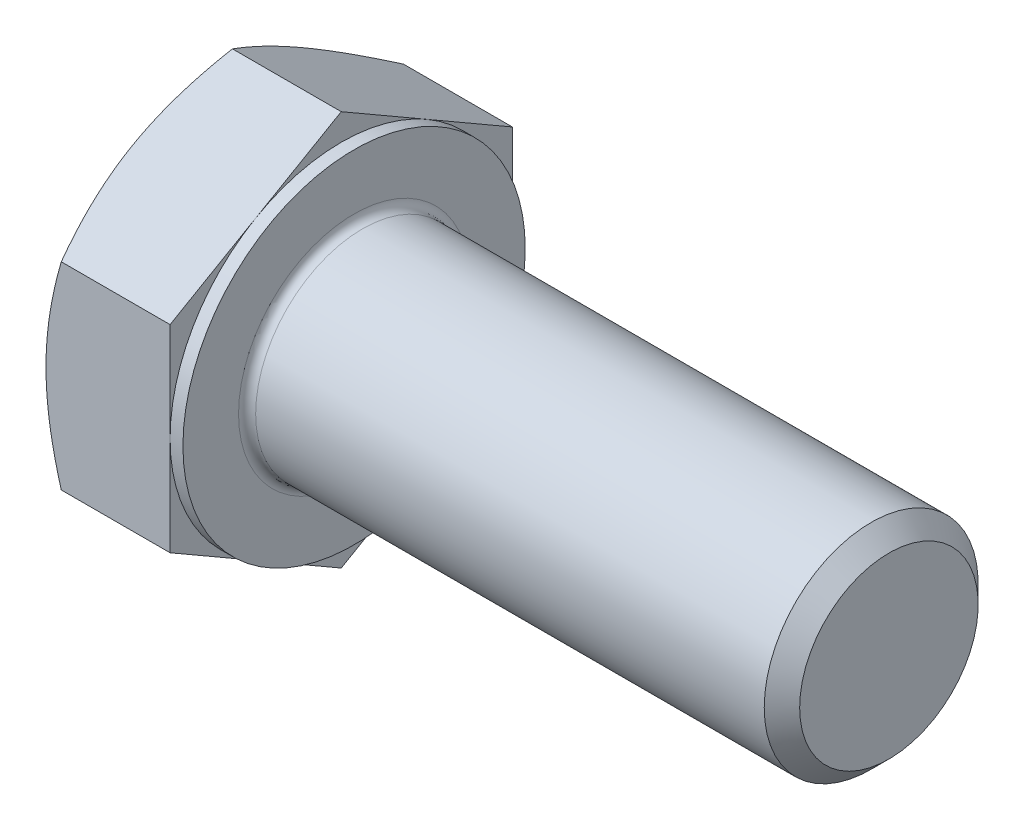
ISO-10303-21;
HEADER;
FILE_DESCRIPTION(('STEP AP214'),'2;1');
FILE_NAME('part.step','',(''),(''),'','','');
FILE_SCHEMA(('AUTOMOTIVE_DESIGN { 1 0 10303 214 1 1 1 1 }'));
ENDSEC;
DATA;
#1=APPLICATION_CONTEXT('core data for automotive mechanical design processes');
#2=APPLICATION_PROTOCOL_DEFINITION('international standard','automotive_design',2000,#1);
#3=PRODUCT_CONTEXT('',#1,'mechanical');
#4=PRODUCT('Part','Part','',(#3));
#5=PRODUCT_RELATED_PRODUCT_CATEGORY('part','',(#4));
#6=PRODUCT_DEFINITION_FORMATION('','',#4);
#7=PRODUCT_DEFINITION_CONTEXT('part definition',#1,'design');
#8=PRODUCT_DEFINITION('design','',#6,#7);
#9=PRODUCT_DEFINITION_SHAPE('','',#8);
#10=(LENGTH_UNIT() NAMED_UNIT(*) SI_UNIT(.MILLI.,.METRE.));
#11=(NAMED_UNIT(*) PLANE_ANGLE_UNIT() SI_UNIT($,.RADIAN.));
#12=(NAMED_UNIT(*) SI_UNIT($,.STERADIAN.) SOLID_ANGLE_UNIT());
#13=UNCERTAINTY_MEASURE_WITH_UNIT(LENGTH_MEASURE(1.E-05),#10,'distance_accuracy_value','');
#14=(GEOMETRIC_REPRESENTATION_CONTEXT(3) GLOBAL_UNCERTAINTY_ASSIGNED_CONTEXT((#13)) GLOBAL_UNIT_ASSIGNED_CONTEXT((#10,
#11,#12)) REPRESENTATION_CONTEXT('',''));
#15=CARTESIAN_POINT('',(0.,0.,0.));
#16=DIRECTION('',(0.,0.,1.));
#17=DIRECTION('',(1.,0.,0.));
#18=AXIS2_PLACEMENT_3D('',#15,#16,#17);
#19=CARTESIAN_POINT('',(6.4,9.23760430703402,0.));
#20=DIRECTION('',(1.,0.,0.));
#21=DIRECTION('',(0.,0.,-1.));
#22=AXIS2_PLACEMENT_3D('',#19,#20,#21);
#23=PLANE('',#22);
#24=CARTESIAN_POINT('',(6.4,0.,0.));
#25=DIRECTION('',(1.,0.,0.));
#26=DIRECTION('',(0.,0.,-1.));
#27=AXIS2_PLACEMENT_3D('',#24,#25,#26);
#28=CIRCLE('',#27,5.4);
#29=CARTESIAN_POINT('',(6.4,0.,-5.4));
#30=VERTEX_POINT('',#29);
#31=EDGE_CURVE('E44',#30,#30,#28,.F.);
#32=ORIENTED_EDGE('',*,*,#31,.T.);
#33=EDGE_LOOP('',(#32));
#34=FACE_BOUND('',#33,.T.);
#35=CARTESIAN_POINT('',(6.4,0.,0.));
#36=DIRECTION('',(1.,0.,0.));
#37=DIRECTION('',(0.,0.,-1.));
#38=AXIS2_PLACEMENT_3D('',#35,#36,#37);
#39=CIRCLE('',#38,8.);
#40=CARTESIAN_POINT('',(6.4,0.,-8.));
#41=VERTEX_POINT('',#40);
#42=EDGE_CURVE('E295',#41,#41,#39,.T.);
#43=ORIENTED_EDGE('',*,*,#42,.T.);
#44=EDGE_LOOP('',(#43));
#45=FACE_BOUND('',#44,.T.);
#46=ADVANCED_FACE('F36',(#34,#45),#23,.T.);
#47=CARTESIAN_POINT('',(0.,0.,0.));
#48=DIRECTION('',(-1.,0.,0.));
#49=DIRECTION('',(0.,0.,1.));
#50=AXIS2_PLACEMENT_3D('',#47,#48,#49);
#51=CYLINDRICAL_SURFACE('',#50,5.);
#52=CARTESIAN_POINT('',(6.8,0.,0.));
#53=DIRECTION('',(1.,0.,0.));
#54=DIRECTION('',(0.,0.,-1.));
#55=AXIS2_PLACEMENT_3D('',#52,#53,#54);
#56=CIRCLE('',#55,5.);
#57=CARTESIAN_POINT('',(6.8,0.,-5.));
#58=VERTEX_POINT('',#57);
#59=EDGE_CURVE('E11',#58,#58,#56,.T.);
#60=ORIENTED_EDGE('',*,*,#59,.T.);
#61=EDGE_LOOP('',(#60));
#62=FACE_BOUND('',#61,.T.);
#63=CARTESIAN_POINT('',(30.572,0.,0.));
#64=DIRECTION('',(-1.,0.,0.));
#65=DIRECTION('',(0.,0.,1.));
#66=AXIS2_PLACEMENT_3D('',#63,#64,#65);
#67=CIRCLE('',#66,5.);
#68=CARTESIAN_POINT('',(30.572,0.,5.));
#69=VERTEX_POINT('',#68);
#70=EDGE_CURVE('E274',#69,#69,#67,.T.);
#71=ORIENTED_EDGE('',*,*,#70,.T.);
#72=EDGE_LOOP('',(#71));
#73=FACE_BOUND('',#72,.T.);
#74=ADVANCED_FACE('F248',(#62,#73),#51,.T.);
#75=CARTESIAN_POINT('',(31.4,0.,0.));
#76=DIRECTION('',(-1.,0.,0.));
#77=DIRECTION('',(0.,0.,1.));
#78=AXIS2_PLACEMENT_3D('',#75,#76,#77);
#79=CONICAL_SURFACE('',#78,4.172,0.785398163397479);
#80=ORIENTED_EDGE('',*,*,#70,.F.);
#81=EDGE_LOOP('',(#80));
#82=FACE_BOUND('',#81,.T.);
#83=CARTESIAN_POINT('',(31.4,0.,0.));
#84=DIRECTION('',(-1.,0.,0.));
#85=DIRECTION('',(0.,0.,1.));
#86=AXIS2_PLACEMENT_3D('',#83,#84,#85);
#87=CIRCLE('',#86,4.172);
#88=CARTESIAN_POINT('',(31.4,0.,4.172));
#89=VERTEX_POINT('',#88);
#90=EDGE_CURVE('E272',#89,#89,#87,.T.);
#91=ORIENTED_EDGE('',*,*,#90,.T.);
#92=EDGE_LOOP('',(#91));
#93=FACE_BOUND('',#92,.T.);
#94=ADVANCED_FACE('F253',(#82,#93),#79,.T.);
#95=CARTESIAN_POINT('',(31.4,0.,0.));
#96=DIRECTION('',(-1.,0.,0.));
#97=DIRECTION('',(0.,0.,1.));
#98=AXIS2_PLACEMENT_3D('',#95,#96,#97);
#99=PLANE('',#98);
#100=ORIENTED_EDGE('',*,*,#90,.F.);
#101=EDGE_LOOP('',(#100));
#102=FACE_BOUND('',#101,.T.);
#103=ADVANCED_FACE('F260',(#102),#99,.F.);
#104=CARTESIAN_POINT('',(5.8,8.00000000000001,0.));
#105=DIRECTION('',(1.,0.,0.));
#106=DIRECTION('',(0.,0.,-1.));
#107=AXIS2_PLACEMENT_3D('',#104,#105,#106);
#108=PLANE('',#107);
#109=DIRECTION('',(0.,0.500000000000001,0.866025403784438));
#110=VECTOR('',#109,1.);
#111=CARTESIAN_POINT('',(5.8,4.61880215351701,-8.00000000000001));
#112=LINE('',#111,#110);
#113=CARTESIAN_POINT('',(5.8,4.61880215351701,-8.00000000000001));
#114=VERTEX_POINT('',#113);
#115=CARTESIAN_POINT('',(5.8,6.92820323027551,-4.));
#116=VERTEX_POINT('',#115);
#117=EDGE_CURVE('E168',#114,#116,#112,.T.);
#118=ORIENTED_EDGE('',*,*,#117,.T.);
#119=CARTESIAN_POINT('',(5.8,0.,0.));
#120=DIRECTION('',(-1.,0.,0.));
#121=DIRECTION('',(0.,0.,1.));
#122=AXIS2_PLACEMENT_3D('',#119,#120,#121);
#123=CIRCLE('',#122,8.);
#124=CARTESIAN_POINT('',(5.8,0.,-8.00000000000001));
#125=VERTEX_POINT('',#124);
#126=EDGE_CURVE('E51',#116,#125,#123,.T.);
#127=ORIENTED_EDGE('',*,*,#126,.T.);
#128=DIRECTION('',(0.,1.,0.));
#129=VECTOR('',#128,1.);
#130=CARTESIAN_POINT('',(5.8,4.61880215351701,-8.00000000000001));
#131=LINE('',#130,#129);
#132=EDGE_CURVE('E298',#125,#114,#131,.T.);
#133=ORIENTED_EDGE('',*,*,#132,.T.);
#134=EDGE_LOOP('',(#118,#127,#133));
#135=FACE_BOUND('',#134,.T.);
#136=ADVANCED_FACE('F263',(#135),#108,.T.);
#137=CARTESIAN_POINT('',(5.8,9.23760430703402,0.));
#138=VERTEX_POINT('',#137);
#139=EDGE_CURVE('E166',#116,#138,#112,.T.);
#140=ORIENTED_EDGE('',*,*,#139,.T.);
#141=DIRECTION('',(0.,-0.500000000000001,0.866025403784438));
#142=VECTOR('',#141,1.);
#143=CARTESIAN_POINT('',(5.8,9.23760430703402,0.));
#144=LINE('',#143,#142);
#145=CARTESIAN_POINT('',(5.8,6.92820323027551,4.));
#146=VERTEX_POINT('',#145);
#147=EDGE_CURVE('E165',#138,#146,#144,.T.);
#148=ORIENTED_EDGE('',*,*,#147,.T.);
#149=EDGE_CURVE('E154',#146,#116,#123,.T.);
#150=ORIENTED_EDGE('',*,*,#149,.T.);
#151=EDGE_LOOP('',(#140,#148,#150));
#152=FACE_BOUND('',#151,.T.);
#153=ADVANCED_FACE('F268',(#152),#108,.T.);
#154=CARTESIAN_POINT('',(5.8,4.61880215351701,7.99999999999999));
#155=VERTEX_POINT('',#154);
#156=EDGE_CURVE('E133',#146,#155,#144,.T.);
#157=ORIENTED_EDGE('',*,*,#156,.T.);
#158=DIRECTION('',(0.,-1.,0.));
#159=VECTOR('',#158,1.);
#160=CARTESIAN_POINT('',(5.8,4.61880215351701,7.99999999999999));
#161=LINE('',#160,#159);
#162=CARTESIAN_POINT('',(5.8,0.,8.00000000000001));
#163=VERTEX_POINT('',#162);
#164=EDGE_CURVE('E127',#155,#163,#161,.T.);
#165=ORIENTED_EDGE('',*,*,#164,.T.);
#166=EDGE_CURVE('E131',#163,#146,#123,.T.);
#167=ORIENTED_EDGE('',*,*,#166,.T.);
#168=EDGE_LOOP('',(#157,#165,#167));
#169=FACE_BOUND('',#168,.T.);
#170=ADVANCED_FACE('F129',(#169),#108,.T.);
#171=CARTESIAN_POINT('',(5.8,-4.618802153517,8.00000000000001));
#172=VERTEX_POINT('',#171);
#173=EDGE_CURVE('E137',#163,#172,#161,.T.);
#174=ORIENTED_EDGE('',*,*,#173,.T.);
#175=DIRECTION('',(0.,-0.500000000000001,-0.866025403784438));
#176=VECTOR('',#175,1.);
#177=CARTESIAN_POINT('',(5.8,-9.23760430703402,0.));
#178=LINE('',#177,#176);
#179=CARTESIAN_POINT('',(5.8,-6.92820323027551,4.));
#180=VERTEX_POINT('',#179);
#181=EDGE_CURVE('E144',#172,#180,#178,.T.);
#182=ORIENTED_EDGE('',*,*,#181,.T.);
#183=EDGE_CURVE('E141',#180,#163,#123,.T.);
#184=ORIENTED_EDGE('',*,*,#183,.T.);
#185=EDGE_LOOP('',(#174,#182,#184));
#186=FACE_BOUND('',#185,.T.);
#187=ADVANCED_FACE('F142',(#186),#108,.T.);
#188=CARTESIAN_POINT('',(5.8,-9.23760430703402,0.));
#189=VERTEX_POINT('',#188);
#190=EDGE_CURVE('E160',#180,#189,#178,.T.);
#191=ORIENTED_EDGE('',*,*,#190,.T.);
#192=DIRECTION('',(0.,0.5,-0.866025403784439));
#193=VECTOR('',#192,1.);
#194=CARTESIAN_POINT('',(5.8,-4.61880215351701,-8.00000000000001));
#195=LINE('',#194,#193);
#196=CARTESIAN_POINT('',(5.8,-6.92820323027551,-4.));
#197=VERTEX_POINT('',#196);
#198=EDGE_CURVE('E336',#189,#197,#195,.T.);
#199=ORIENTED_EDGE('',*,*,#198,.T.);
#200=EDGE_CURVE('E148',#197,#180,#123,.T.);
#201=ORIENTED_EDGE('',*,*,#200,.T.);
#202=EDGE_LOOP('',(#191,#199,#201));
#203=FACE_BOUND('',#202,.T.);
#204=ADVANCED_FACE('F337',(#203),#108,.T.);
#205=CARTESIAN_POINT('',(5.8,-4.61880215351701,-8.00000000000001));
#206=VERTEX_POINT('',#205);
#207=EDGE_CURVE('E155',#197,#206,#195,.T.);
#208=ORIENTED_EDGE('',*,*,#207,.T.);
#209=EDGE_CURVE('E299',#206,#125,#131,.T.);
#210=ORIENTED_EDGE('',*,*,#209,.T.);
#211=EDGE_CURVE('E306',#125,#197,#123,.T.);
#212=ORIENTED_EDGE('',*,*,#211,.T.);
#213=EDGE_LOOP('',(#208,#210,#212));
#214=FACE_BOUND('',#213,.T.);
#215=ADVANCED_FACE('F269',(#214),#108,.T.);
#216=CARTESIAN_POINT('',(0.,0.,0.));
#217=DIRECTION('',(-1.,0.,0.));
#218=DIRECTION('',(0.,0.,1.));
#219=AXIS2_PLACEMENT_3D('',#216,#217,#218);
#220=CYLINDRICAL_SURFACE('',#219,8.);
#221=ORIENTED_EDGE('',*,*,#126,.F.);
#222=ORIENTED_EDGE('',*,*,#149,.F.);
#223=ORIENTED_EDGE('',*,*,#166,.F.);
#224=ORIENTED_EDGE('',*,*,#183,.F.);
#225=ORIENTED_EDGE('',*,*,#200,.F.);
#226=ORIENTED_EDGE('',*,*,#211,.F.);
#227=EDGE_LOOP('',(#221,#222,#223,#224,#225,#226));
#228=FACE_BOUND('',#227,.T.);
#229=ORIENTED_EDGE('',*,*,#42,.F.);
#230=EDGE_LOOP('',(#229));
#231=FACE_BOUND('',#230,.T.);
#232=ADVANCED_FACE('F151',(#228,#231),#220,.T.);
#233=CARTESIAN_POINT('',(0.,9.23760430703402,0.));
#234=DIRECTION('',(1.,0.,0.));
#235=DIRECTION('',(0.,0.,-1.));
#236=AXIS2_PLACEMENT_3D('',#233,#234,#235);
#237=PLANE('',#236);
#238=CARTESIAN_POINT('',(0.,0.,0.));
#239=DIRECTION('',(1.,0.,0.));
#240=DIRECTION('',(0.,0.,-1.));
#241=AXIS2_PLACEMENT_3D('',#238,#239,#240);
#242=CIRCLE('',#241,8.);
#243=CARTESIAN_POINT('',(0.,0.,-8.00000000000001));
#244=VERTEX_POINT('',#243);
#245=CARTESIAN_POINT('',(0.,6.92820323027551,-4.));
#246=VERTEX_POINT('',#245);
#247=EDGE_CURVE('E294',#244,#246,#242,.T.);
#248=ORIENTED_EDGE('',*,*,#247,.F.);
#249=CARTESIAN_POINT('',(0.,-6.92820323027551,-4.));
#250=VERTEX_POINT('',#249);
#251=EDGE_CURVE('E290',#250,#244,#242,.T.);
#252=ORIENTED_EDGE('',*,*,#251,.F.);
#253=CARTESIAN_POINT('',(0.,-6.9282032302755,4.));
#254=VERTEX_POINT('',#253);
#255=EDGE_CURVE('E293',#254,#250,#242,.T.);
#256=ORIENTED_EDGE('',*,*,#255,.F.);
#257=CARTESIAN_POINT('',(0.,0.,8.00000000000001));
#258=VERTEX_POINT('',#257);
#259=EDGE_CURVE('E329',#258,#254,#242,.T.);
#260=ORIENTED_EDGE('',*,*,#259,.F.);
#261=CARTESIAN_POINT('',(0.,0.,0.));
#262=DIRECTION('',(-1.,0.,0.));
#263=DIRECTION('',(0.,0.,1.));
#264=AXIS2_PLACEMENT_3D('',#261,#262,#263);
#265=CIRCLE('',#264,8.);
#266=CARTESIAN_POINT('',(0.,6.92820323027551,4.));
#267=VERTEX_POINT('',#266);
#268=EDGE_CURVE('E169',#258,#267,#265,.T.);
#269=ORIENTED_EDGE('',*,*,#268,.T.);
#270=EDGE_CURVE('E352',#246,#267,#242,.T.);
#271=ORIENTED_EDGE('',*,*,#270,.F.);
#272=EDGE_LOOP('',(#248,#252,#256,#260,#269,#271));
#273=FACE_BOUND('',#272,.T.);
#274=ADVANCED_FACE('F198',(#273),#237,.F.);
#275=CARTESIAN_POINT('',(0.,0.,0.));
#276=DIRECTION('',(1.,0.,0.));
#277=DIRECTION('',(0.,0.,-1.));
#278=AXIS2_PLACEMENT_3D('',#275,#276,#277);
#279=CONICAL_SURFACE('',#278,8.,1.0471975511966);
#280=CARTESIAN_POINT('',(0.714597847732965,4.61868668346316,8.0002));
#281=CARTESIAN_POINT('',(0.655990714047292,4.72021302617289,7.8243512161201));
#282=CARTESIAN_POINT('',(0.600043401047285,4.82211789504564,7.64784680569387));
#283=CARTESIAN_POINT('',(0.494201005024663,5.02675523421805,7.29340453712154));
#284=CARTESIAN_POINT('',(0.444308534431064,5.12948804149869,7.11546609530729));
#285=CARTESIAN_POINT('',(0.304692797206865,5.43933133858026,6.57880176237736));
#286=CARTESIAN_POINT('',(0.225281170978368,5.64766491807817,6.21795741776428));
#287=CARTESIAN_POINT('',(0.132161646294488,5.95943209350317,5.67796082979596));
#288=CARTESIAN_POINT('',(0.105634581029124,6.06193429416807,5.50042181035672));
#289=CARTESIAN_POINT('',(0.0611531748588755,6.26740224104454,5.14454088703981));
#290=CARTESIAN_POINT('',(0.0431980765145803,6.37036794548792,4.96619905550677));
#291=CARTESIAN_POINT('',(0.0163156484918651,6.57647664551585,4.60920831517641));
#292=CARTESIAN_POINT('',(0.00737807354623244,6.67961930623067,4.43055998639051));
#293=CARTESIAN_POINT('',(-0.00127769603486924,6.88599991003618,4.07309829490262));
#294=CARTESIAN_POINT('',(-0.000996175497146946,6.98923785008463,3.89428493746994));
#295=CARTESIAN_POINT('',(0.00814502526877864,7.18224506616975,3.5599866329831));
#296=CARTESIAN_POINT('',(0.0158896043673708,7.27202796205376,3.40447809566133));
#297=CARTESIAN_POINT('',(0.0382011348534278,7.45138347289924,3.0938252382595));
#298=CARTESIAN_POINT('',(0.0527685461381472,7.5409560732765,2.93868094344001));
#299=CARTESIAN_POINT('',(0.106360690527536,7.80932710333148,2.47384868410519));
#300=CARTESIAN_POINT('',(0.155268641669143,7.98765049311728,2.16498351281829));
#301=CARTESIAN_POINT('',(0.277539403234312,8.34618890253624,1.54397677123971));
#302=CARTESIAN_POINT('',(0.351420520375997,8.52635816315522,1.23191445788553));
#303=CARTESIAN_POINT('',(0.519100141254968,8.88400987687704,0.612443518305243));
#304=CARTESIAN_POINT('',(0.612859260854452,9.06149691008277,0.305026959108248));
#305=CARTESIAN_POINT('',(0.714597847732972,9.23771977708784,-0.000200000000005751));
#306=B_SPLINE_CURVE_WITH_KNOTS('',3,(#280,#281,#282,#283,#284,#285,#286,#287,#288,#289,#290,
#291,#292,#293,#294,#295,#296,#297,#298,#299,#300,#301,#302,#303,#304,#305),.UNSPECIFIED.,.F.,
.F.,(4,2,2,2,2,2,2,2,2,2,2,2,4),(0.,0.63397354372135,1.26821965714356,2.53934712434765,
3.15934343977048,3.77928496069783,4.39852133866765,5.01773858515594,5.55680239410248,
6.09590254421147,7.17487077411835,8.27776850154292,9.37850115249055),.UNSPECIFIED.);
#307=CARTESIAN_POINT('',(0.714531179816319,9.23760430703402,0.));
#308=VERTEX_POINT('',#307);
#309=EDGE_CURVE('E217',#267,#308,#306,.T.);
#310=ORIENTED_EDGE('',*,*,#309,.T.);
#311=CARTESIAN_POINT('',(0.714597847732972,9.23771977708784,0.000200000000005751));
#312=CARTESIAN_POINT('',(0.6559907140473,9.13619343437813,-0.175648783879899));
#313=CARTESIAN_POINT('',(0.600043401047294,9.03428856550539,-0.352153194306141));
#314=CARTESIAN_POINT('',(0.494201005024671,8.82965122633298,-0.706595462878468));
#315=CARTESIAN_POINT('',(0.444308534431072,8.72691841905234,-0.884533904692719));
#316=CARTESIAN_POINT('',(0.304692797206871,8.41707512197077,-1.42119823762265));
#317=CARTESIAN_POINT('',(0.225281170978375,8.20874154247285,-1.78204258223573));
#318=CARTESIAN_POINT('',(0.132161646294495,7.89697436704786,-2.32203917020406));
#319=CARTESIAN_POINT('',(0.10563458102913,7.79447216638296,-2.49957818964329));
#320=CARTESIAN_POINT('',(0.0611531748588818,7.58900421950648,-2.8554591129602));
#321=CARTESIAN_POINT('',(0.043198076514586,7.48603851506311,-3.03380094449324));
#322=CARTESIAN_POINT('',(0.0163156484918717,7.27992981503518,-3.3907916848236));
#323=CARTESIAN_POINT('',(0.0073780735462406,7.17678715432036,-3.56944001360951));
#324=CARTESIAN_POINT('',(-0.00127769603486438,6.97040655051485,-3.92690170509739));
#325=CARTESIAN_POINT('',(-0.000996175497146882,6.86716861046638,-4.10571506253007));
#326=CARTESIAN_POINT('',(0.00814502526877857,6.67416139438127,-4.44001336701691));
#327=CARTESIAN_POINT('',(0.0158896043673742,6.58437849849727,-4.59552190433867));
#328=CARTESIAN_POINT('',(0.0382011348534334,6.40502298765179,-4.90617476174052));
#329=CARTESIAN_POINT('',(0.0527685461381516,6.31545038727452,-5.06131905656));
#330=CARTESIAN_POINT('',(0.106360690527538,6.04707935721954,-5.52615131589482));
#331=CARTESIAN_POINT('',(0.155268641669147,5.86875596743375,-5.83501648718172));
#332=CARTESIAN_POINT('',(0.277539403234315,5.51021755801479,-6.4560232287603));
#333=CARTESIAN_POINT('',(0.351420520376,5.33004829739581,-6.76808554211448));
#334=CARTESIAN_POINT('',(0.519100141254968,4.97239658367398,-7.38755648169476));
#335=CARTESIAN_POINT('',(0.612859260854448,4.79490955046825,-7.69497304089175));
#336=CARTESIAN_POINT('',(0.714597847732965,4.61868668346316,-8.0002));
#337=B_SPLINE_CURVE_WITH_KNOTS('',3,(#311,#312,#313,#314,#315,#316,#317,#318,#319,#320,#321,
#322,#323,#324,#325,#326,#327,#328,#329,#330,#331,#332,#333,#334,#335,#336),.UNSPECIFIED.,.F.,
.F.,(4,2,2,2,2,2,2,2,2,2,2,2,4),(0.,0.63397354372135,1.26821965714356,2.53934712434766,
3.15934343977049,3.77928496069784,4.39852133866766,5.01773858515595,5.55680239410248,
6.09590254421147,7.17487077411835,8.27776850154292,9.37850115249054),.UNSPECIFIED.);
#338=EDGE_CURVE('E59',#308,#246,#337,.T.);
#339=ORIENTED_EDGE('',*,*,#338,.T.);
#340=ORIENTED_EDGE('',*,*,#270,.T.);
#341=EDGE_LOOP('',(#310,#339,#340));
#342=FACE_BOUND('',#341,.T.);
#343=ADVANCED_FACE('F353',(#342),#279,.T.);
#344=CARTESIAN_POINT('',(4.02490591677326,-12.6546855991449,8.00000000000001));
#345=CARTESIAN_POINT('',(3.85338488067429,-12.3031246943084,8.));
#346=CARTESIAN_POINT('',(3.68343820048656,-11.9507829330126,8.));
#347=CARTESIAN_POINT('',(3.3475742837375,-11.2441233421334,8.));
#348=CARTESIAN_POINT('',(3.18165763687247,-10.8898052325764,8.));
#349=CARTESIAN_POINT('',(2.85395194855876,-10.177068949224,8.));
#350=CARTESIAN_POINT('',(2.69218825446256,-9.81863908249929,8.));
#351=CARTESIAN_POINT('',(2.37495727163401,-9.09901413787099,8.));
#352=CARTESIAN_POINT('',(2.21948970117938,-8.73781918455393,8.));
#353=CARTESIAN_POINT('',(1.91124909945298,-7.9995005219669,8.));
#354=CARTESIAN_POINT('',(1.75875676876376,-7.6222589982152,8.));
#355=CARTESIAN_POINT('',(1.46472411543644,-6.86345577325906,8.));
#356=CARTESIAN_POINT('',(1.32318498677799,-6.48189360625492,8.));
#357=CARTESIAN_POINT('',(1.05459432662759,-5.71447512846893,7.99999999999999));
#358=CARTESIAN_POINT('',(0.927515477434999,-5.32862847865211,7.99999999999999));
#359=CARTESIAN_POINT('',(0.691757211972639,-4.55141880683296,8.));
#360=CARTESIAN_POINT('',(0.583072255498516,-4.16005748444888,8.00000000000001));
#361=CARTESIAN_POINT('',(0.389750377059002,-3.37376378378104,8.00000000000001));
#362=CARTESIAN_POINT('',(0.304973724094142,-2.97886668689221,8.));
#363=CARTESIAN_POINT('',(0.199275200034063,-2.38273452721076,7.99999999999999));
#364=CARTESIAN_POINT('',(0.167618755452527,-2.18337977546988,7.99999999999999));
#365=CARTESIAN_POINT('',(0.112075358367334,-1.78359737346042,7.99999999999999));
#366=CARTESIAN_POINT('',(0.088187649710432,-1.58316982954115,7.99999999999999));
#367=CARTESIAN_POINT('',(0.0489706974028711,-1.18423541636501,7.99999999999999));
#368=CARTESIAN_POINT('',(0.0335291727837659,-0.985739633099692,7.99999999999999));
#369=CARTESIAN_POINT('',(0.0110629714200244,-0.588272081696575,7.99999999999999));
#370=CARTESIAN_POINT('',(0.00403814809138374,-0.389300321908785,7.99999999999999));
#371=CARTESIAN_POINT('',(-0.00142584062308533,0.00876221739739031,7.99999999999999));
#372=CARTESIAN_POINT('',(0.00013495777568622,0.207852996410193,7.99999999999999));
#373=CARTESIAN_POINT('',(0.0118014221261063,0.605786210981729,7.99999999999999));
#374=CARTESIAN_POINT('',(0.0219074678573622,0.804628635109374,7.99999999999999));
#375=CARTESIAN_POINT('',(0.0557165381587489,1.27520492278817,7.99999999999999));
#376=CARTESIAN_POINT('',(0.0830672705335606,1.5466829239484,7.99999999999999));
#377=CARTESIAN_POINT('',(0.152259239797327,2.08777093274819,7.99999999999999));
#378=CARTESIAN_POINT('',(0.194102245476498,2.3573807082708,7.99999999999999));
#379=CARTESIAN_POINT('',(0.339163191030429,3.1630177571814,7.99999999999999));
#380=CARTESIAN_POINT('',(0.461891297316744,3.69558689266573,7.99999999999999));
#381=CARTESIAN_POINT('',(0.67658659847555,4.49226054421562,7.99999999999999));
#382=CARTESIAN_POINT('',(0.754301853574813,4.76044513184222,7.99999999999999));
#383=CARTESIAN_POINT('',(0.918275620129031,5.29421545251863,7.99999999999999));
#384=CARTESIAN_POINT('',(1.00453419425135,5.55980116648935,7.99999999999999));
#385=CARTESIAN_POINT('',(1.18417203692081,6.08844838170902,7.99999999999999));
#386=CARTESIAN_POINT('',(1.27754932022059,6.35151056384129,7.99999999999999));
#387=CARTESIAN_POINT('',(1.47027925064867,6.8754242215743,7.99999999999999));
#388=CARTESIAN_POINT('',(1.56963178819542,7.13627573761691,7.99999999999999));
#389=CARTESIAN_POINT('',(1.83061788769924,7.80218876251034,7.99999999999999));
#390=CARTESIAN_POINT('',(1.99585031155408,8.20583801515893,7.99999999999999));
#391=CARTESIAN_POINT('',(2.33560644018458,9.00922091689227,7.99999999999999));
#392=CARTESIAN_POINT('',(2.51013099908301,9.4089542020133,7.99999999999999));
#393=CARTESIAN_POINT('',(2.86641485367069,10.2053302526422,7.99999999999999));
#394=CARTESIAN_POINT('',(3.04817649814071,10.6019719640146,7.99999999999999));
#395=CARTESIAN_POINT('',(3.41731475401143,11.3926098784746,7.99999999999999));
#396=CARTESIAN_POINT('',(3.60469118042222,11.7866061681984,7.99999999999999));
#397=CARTESIAN_POINT('',(3.98417977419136,12.5730081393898,7.99999999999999));
#398=CARTESIAN_POINT('',(4.17629838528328,12.9654107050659,7.99999999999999));
#399=CARTESIAN_POINT('',(4.56413461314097,13.7484335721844,7.99999999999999));
#400=CARTESIAN_POINT('',(4.75985225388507,14.1390538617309,7.99999999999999));
#401=CARTESIAN_POINT('',(5.15417791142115,14.9187387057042,7.99999999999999));
#402=CARTESIAN_POINT('',(5.35278537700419,15.3078035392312,7.99999999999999));
#403=CARTESIAN_POINT('',(5.75241278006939,16.0846929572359,7.99999999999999));
#404=CARTESIAN_POINT('',(5.95343272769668,16.4725175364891,7.99999999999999));
#405=CARTESIAN_POINT('',(6.52023158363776,17.559169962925,7.99999999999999));
#406=CARTESIAN_POINT('',(6.88826669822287,18.2568208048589,7.99999999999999));
#407=CARTESIAN_POINT('',(7.62911646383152,19.6496204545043,7.99999999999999));
#408=CARTESIAN_POINT('',(8.00193136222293,20.3447691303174,7.99999999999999));
#409=CARTESIAN_POINT('',(8.74998840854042,21.7309493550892,7.99999999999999));
#410=CARTESIAN_POINT('',(9.12521930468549,22.4219869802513,7.99999999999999));
#411=CARTESIAN_POINT('',(9.69012626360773,23.4573861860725,7.99999999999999));
#412=CARTESIAN_POINT('',(9.87876537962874,23.8023143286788,7.99999999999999));
#413=CARTESIAN_POINT('',(10.2566598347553,24.491832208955,7.99999999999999));
#414=CARTESIAN_POINT('',(10.4459151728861,24.8364219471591,7.99999999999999));
#415=CARTESIAN_POINT('',(10.6354414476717,25.1808626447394,7.99999999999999));
#416=B_SPLINE_CURVE_WITH_KNOTS('',3,(#344,#345,#346,#347,#348,#349,#350,#351,#352,#353,#354,
#355,#356,#357,#358,#359,#360,#361,#362,#363,#364,#365,#366,#367,#368,#369,#370,#371,#372,#373,
#374,#375,#376,#377,#378,#379,#380,#381,#382,#383,#384,#385,#386,#387,#388,#389,#390,#391,#392,
#393,#394,#395,#396,#397,#398,#399,#400,#401,#402,#403,#404,#405,#406,#407,#408,#409,#410,#411,
#412,#413,#414,#415),.UNSPECIFIED.,.F.,.F.,(4,2,2,2,2,2,2,2,2,2,2,2,2,2,2,2,2,2,2,2,2,2,2,2,2,2,
2,2,2,2,2,2,2,2,2,4),(0.,1.17352534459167,2.34722138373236,3.52689945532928,4.70652468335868,
5.92708318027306,7.14777454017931,8.36612013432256,9.58409810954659,10.7948027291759,
11.40023293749,12.0056041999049,12.6027191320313,13.1998236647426,13.7969256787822,
14.3940542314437,15.2121538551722,16.0303533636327,17.6675489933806,18.5051258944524,
19.3427089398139,20.180059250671,21.0173942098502,22.3257038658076,23.6341339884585,
24.9429922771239,26.2518074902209,27.5625113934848,28.8732240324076,30.1836898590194,
31.4941611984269,33.8604586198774,36.2268790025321,38.5858914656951,39.7653151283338,
40.9447369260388),.UNSPECIFIED.);
#417=CARTESIAN_POINT('',(0.714531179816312,4.61880215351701,7.99999999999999));
#418=VERTEX_POINT('',#417);
#419=EDGE_CURVE('E229',#258,#418,#416,.T.);
#420=ORIENTED_EDGE('',*,*,#419,.T.);
#421=EDGE_CURVE('E228',#418,#267,#306,.T.);
#422=ORIENTED_EDGE('',*,*,#421,.T.);
#423=ORIENTED_EDGE('',*,*,#268,.F.);
#424=EDGE_LOOP('',(#420,#422,#423));
#425=FACE_BOUND('',#424,.T.);
#426=ADVANCED_FACE('F323',(#425),#279,.T.);
#427=CARTESIAN_POINT('',(0.714531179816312,-4.618802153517,8.00000000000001));
#428=VERTEX_POINT('',#427);
#429=EDGE_CURVE('E275',#428,#258,#416,.T.);
#430=ORIENTED_EDGE('',*,*,#429,.T.);
#431=ORIENTED_EDGE('',*,*,#259,.T.);
#432=CARTESIAN_POINT('',(0.714597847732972,-9.23771977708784,-0.000200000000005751));
#433=CARTESIAN_POINT('',(0.655990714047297,-9.13619343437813,0.175648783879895));
#434=CARTESIAN_POINT('',(0.60004340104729,-9.03428856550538,0.352153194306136));
#435=CARTESIAN_POINT('',(0.494201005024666,-8.82965122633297,0.706595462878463));
#436=CARTESIAN_POINT('',(0.444308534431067,-8.72691841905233,0.884533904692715));
#437=CARTESIAN_POINT('',(0.304692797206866,-8.41707512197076,1.42119823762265));
#438=CARTESIAN_POINT('',(0.225281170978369,-8.20874154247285,1.78204258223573));
#439=CARTESIAN_POINT('',(0.132161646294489,-7.89697436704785,2.32203917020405));
#440=CARTESIAN_POINT('',(0.105634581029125,-7.79447216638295,2.49957818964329));
#441=CARTESIAN_POINT('',(0.0611531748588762,-7.58900421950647,2.8554591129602));
#442=CARTESIAN_POINT('',(0.0431980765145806,-7.4860385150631,3.03380094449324));
#443=CARTESIAN_POINT('',(0.0163156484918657,-7.27992981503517,3.3907916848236));
#444=CARTESIAN_POINT('',(0.00737807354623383,-7.17678715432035,3.56944001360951));
#445=CARTESIAN_POINT('',(-0.00127769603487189,-6.97040655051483,3.92690170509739));
#446=CARTESIAN_POINT('',(-0.000996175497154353,-6.86716861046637,4.10571506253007));
#447=CARTESIAN_POINT('',(0.00814502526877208,-6.67416139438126,4.44001336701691));
#448=CARTESIAN_POINT('',(0.0158896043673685,-6.58437849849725,4.59552190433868));
#449=CARTESIAN_POINT('',(0.0382011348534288,-6.40502298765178,4.90617476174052));
#450=CARTESIAN_POINT('',(0.0527685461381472,-6.31545038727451,5.06131905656));
#451=CARTESIAN_POINT('',(0.106360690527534,-6.04707935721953,5.52615131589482));
#452=CARTESIAN_POINT('',(0.155268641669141,-5.86875596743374,5.83501648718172));
#453=CARTESIAN_POINT('',(0.277539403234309,-5.51021755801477,6.4560232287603));
#454=CARTESIAN_POINT('',(0.351420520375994,-5.3300482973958,6.76808554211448));
#455=CARTESIAN_POINT('',(0.519100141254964,-4.97239658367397,7.38755648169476));
#456=CARTESIAN_POINT('',(0.612859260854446,-4.79490955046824,7.69497304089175));
#457=CARTESIAN_POINT('',(0.714597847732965,-4.61868668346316,8.0002));
#458=B_SPLINE_CURVE_WITH_KNOTS('',3,(#432,#433,#434,#435,#436,#437,#438,#439,#440,#441,#442,
#443,#444,#445,#446,#447,#448,#449,#450,#451,#452,#453,#454,#455,#456,#457),.UNSPECIFIED.,.F.,
.F.,(4,2,2,2,2,2,2,2,2,2,2,2,4),(0.,0.633973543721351,1.26821965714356,2.53934712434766,
3.15934343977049,3.77928496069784,4.39852133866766,5.01773858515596,5.55680239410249,
6.09590254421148,7.17487077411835,8.27776850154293,9.37850115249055),.UNSPECIFIED.);
#459=EDGE_CURVE('E219',#254,#428,#458,.T.);
#460=ORIENTED_EDGE('',*,*,#459,.T.);
#461=EDGE_LOOP('',(#430,#431,#460));
#462=FACE_BOUND('',#461,.T.);
#463=ADVANCED_FACE('F187',(#462),#279,.T.);
#464=CARTESIAN_POINT('',(0.714531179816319,-9.23760430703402,0.));
#465=VERTEX_POINT('',#464);
#466=EDGE_CURVE('E212',#465,#254,#458,.T.);
#467=ORIENTED_EDGE('',*,*,#466,.T.);
#468=ORIENTED_EDGE('',*,*,#255,.T.);
#469=CARTESIAN_POINT('',(0.714597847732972,-4.61868668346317,-8.0002));
#470=CARTESIAN_POINT('',(0.655990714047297,-4.7202130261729,-7.8243512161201));
#471=CARTESIAN_POINT('',(0.60004340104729,-4.82211789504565,-7.64784680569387));
#472=CARTESIAN_POINT('',(0.494201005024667,-5.02675523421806,-7.29340453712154));
#473=CARTESIAN_POINT('',(0.444308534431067,-5.1294880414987,-7.11546609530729));
#474=CARTESIAN_POINT('',(0.304692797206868,-5.43933133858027,-6.57880176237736));
#475=CARTESIAN_POINT('',(0.225281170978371,-5.64766491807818,-6.21795741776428));
#476=CARTESIAN_POINT('',(0.132161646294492,-5.95943209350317,-5.67796082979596));
#477=CARTESIAN_POINT('',(0.105634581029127,-6.06193429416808,-5.50042181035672));
#478=CARTESIAN_POINT('',(0.0611531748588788,-6.26740224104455,-5.14454088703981));
#479=CARTESIAN_POINT('',(0.0431980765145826,-6.37036794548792,-4.96619905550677));
#480=CARTESIAN_POINT('',(0.016315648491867,-6.57647664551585,-4.60920831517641));
#481=CARTESIAN_POINT('',(0.00737807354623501,-6.67961930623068,-4.43055998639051));
#482=CARTESIAN_POINT('',(-0.00127769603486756,-6.88599991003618,-4.07309829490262));
#483=CARTESIAN_POINT('',(-0.000996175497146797,-6.98923785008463,-3.89428493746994));
#484=CARTESIAN_POINT('',(0.00814502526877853,-7.18224506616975,-3.5599866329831));
#485=CARTESIAN_POINT('',(0.0158896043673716,-7.27202796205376,-3.40447809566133));
#486=CARTESIAN_POINT('',(0.0382011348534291,-7.45138347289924,-3.0938252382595));
#487=CARTESIAN_POINT('',(0.0527685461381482,-7.54095607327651,-2.93868094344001));
#488=CARTESIAN_POINT('',(0.106360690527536,-7.80932710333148,-2.47384868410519));
#489=CARTESIAN_POINT('',(0.155268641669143,-7.98765049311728,-2.16498351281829));
#490=CARTESIAN_POINT('',(0.277539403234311,-8.34618890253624,-1.5439767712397));
#491=CARTESIAN_POINT('',(0.351420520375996,-8.52635816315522,-1.23191445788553));
#492=CARTESIAN_POINT('',(0.519100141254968,-8.88400987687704,-0.612443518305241));
#493=CARTESIAN_POINT('',(0.612859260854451,-9.06149691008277,-0.305026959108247));
#494=CARTESIAN_POINT('',(0.714597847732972,-9.23771977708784,0.000200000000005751));
#495=B_SPLINE_CURVE_WITH_KNOTS('',3,(#469,#470,#471,#472,#473,#474,#475,#476,#477,#478,#479,
#480,#481,#482,#483,#484,#485,#486,#487,#488,#489,#490,#491,#492,#493,#494),.UNSPECIFIED.,.F.,
.F.,(4,2,2,2,2,2,2,2,2,2,2,2,4),(0.,0.633973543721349,1.26821965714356,2.53934712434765,
3.15934343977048,3.77928496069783,4.39852133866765,5.01773858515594,5.55680239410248,
6.09590254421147,7.17487077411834,8.27776850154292,9.37850115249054),.UNSPECIFIED.);
#496=EDGE_CURVE('E218',#250,#465,#495,.T.);
#497=ORIENTED_EDGE('',*,*,#496,.T.);
#498=EDGE_LOOP('',(#467,#468,#497));
#499=FACE_BOUND('',#498,.T.);
#500=ADVANCED_FACE('F351',(#499),#279,.T.);
#501=CARTESIAN_POINT('',(0.714531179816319,4.61880215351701,-8.00000000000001));
#502=VERTEX_POINT('',#501);
#503=EDGE_CURVE('E220',#246,#502,#337,.T.);
#504=ORIENTED_EDGE('',*,*,#503,.T.);
#505=CARTESIAN_POINT('',(4.02490591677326,-12.6546855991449,-8.00000000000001));
#506=CARTESIAN_POINT('',(3.85338488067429,-12.3031246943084,-8.00000000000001));
#507=CARTESIAN_POINT('',(3.68343820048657,-11.9507829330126,-8.00000000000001));
#508=CARTESIAN_POINT('',(3.34757428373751,-11.2441233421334,-8.00000000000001));
#509=CARTESIAN_POINT('',(3.18165763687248,-10.8898052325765,-8.00000000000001));
#510=CARTESIAN_POINT('',(2.85395194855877,-10.177068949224,-8.00000000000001));
#511=CARTESIAN_POINT('',(2.69218825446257,-9.8186390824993,-8.00000000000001));
#512=CARTESIAN_POINT('',(2.37495727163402,-9.099014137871,-8.00000000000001));
#513=CARTESIAN_POINT('',(2.21948970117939,-8.73781918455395,-8.00000000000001));
#514=CARTESIAN_POINT('',(1.91124909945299,-7.99950052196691,-8.00000000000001));
#515=CARTESIAN_POINT('',(1.75875676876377,-7.62225899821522,-8.00000000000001));
#516=CARTESIAN_POINT('',(1.46472411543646,-6.86345577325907,-8.00000000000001));
#517=CARTESIAN_POINT('',(1.32318498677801,-6.48189360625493,-8.00000000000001));
#518=CARTESIAN_POINT('',(1.0545943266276,-5.71447512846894,-8.00000000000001));
#519=CARTESIAN_POINT('',(0.92751547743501,-5.32862847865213,-8.00000000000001));
#520=CARTESIAN_POINT('',(0.691757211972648,-4.55141880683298,-8.00000000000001));
#521=CARTESIAN_POINT('',(0.583072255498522,-4.16005748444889,-8.00000000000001));
#522=CARTESIAN_POINT('',(0.389750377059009,-3.37376378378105,-8.00000000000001));
#523=CARTESIAN_POINT('',(0.304973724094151,-2.97886668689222,-8.00000000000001));
#524=CARTESIAN_POINT('',(0.199275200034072,-2.38273452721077,-8.00000000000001));
#525=CARTESIAN_POINT('',(0.167618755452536,-2.18337977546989,-8.00000000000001));
#526=CARTESIAN_POINT('',(0.112075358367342,-1.78359737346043,-8.00000000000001));
#527=CARTESIAN_POINT('',(0.0881876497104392,-1.58316982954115,-8.00000000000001));
#528=CARTESIAN_POINT('',(0.0489706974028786,-1.18423541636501,-8.00000000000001));
#529=CARTESIAN_POINT('',(0.0335291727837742,-0.985739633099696,-8.00000000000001));
#530=CARTESIAN_POINT('',(0.011062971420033,-0.588272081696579,-8.00000000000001));
#531=CARTESIAN_POINT('',(0.00403814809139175,-0.389300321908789,-8.00000000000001));
#532=CARTESIAN_POINT('',(-0.00142584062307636,0.00876221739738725,-8.00000000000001));
#533=CARTESIAN_POINT('',(0.00013495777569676,0.20785299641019,-8.00000000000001));
#534=CARTESIAN_POINT('',(0.0118014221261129,0.605786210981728,-8.00000000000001));
#535=CARTESIAN_POINT('',(0.0219074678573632,0.804628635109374,-8.00000000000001));
#536=CARTESIAN_POINT('',(0.0557165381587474,1.27520492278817,-8.00000000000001));
#537=CARTESIAN_POINT('',(0.0830672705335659,1.54668292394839,-8.00000000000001));
#538=CARTESIAN_POINT('',(0.152259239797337,2.08777093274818,-8.00000000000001));
#539=CARTESIAN_POINT('',(0.194102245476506,2.3573807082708,-8.00000000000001));
#540=CARTESIAN_POINT('',(0.339163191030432,3.16301775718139,-8.00000000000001));
#541=CARTESIAN_POINT('',(0.461891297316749,3.69558689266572,-8.00000000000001));
#542=CARTESIAN_POINT('',(0.676586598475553,4.4922605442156,-8.00000000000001));
#543=CARTESIAN_POINT('',(0.754301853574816,4.7604451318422,-8.00000000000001));
#544=CARTESIAN_POINT('',(0.918275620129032,5.29421545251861,-8.00000000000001));
#545=CARTESIAN_POINT('',(1.00453419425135,5.55980116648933,-8.00000000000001));
#546=CARTESIAN_POINT('',(1.1841720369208,6.088448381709,-8.00000000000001));
#547=CARTESIAN_POINT('',(1.27754932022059,6.35151056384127,-8.00000000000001));
#548=CARTESIAN_POINT('',(1.47027925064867,6.87542422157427,-8.00000000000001));
#549=CARTESIAN_POINT('',(1.56963178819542,7.13627573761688,-8.00000000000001));
#550=CARTESIAN_POINT('',(1.83061788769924,7.80218876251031,-8.00000000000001));
#551=CARTESIAN_POINT('',(1.99585031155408,8.20583801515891,-8.00000000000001));
#552=CARTESIAN_POINT('',(2.33560644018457,9.00922091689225,-8.00000000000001));
#553=CARTESIAN_POINT('',(2.51013099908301,9.40895420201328,-8.00000000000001));
#554=CARTESIAN_POINT('',(2.86641485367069,10.2053302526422,-8.00000000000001));
#555=CARTESIAN_POINT('',(3.04817649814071,10.6019719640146,-8.00000000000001));
#556=CARTESIAN_POINT('',(3.41731475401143,11.3926098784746,-8.00000000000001));
#557=CARTESIAN_POINT('',(3.60469118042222,11.7866061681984,-8.00000000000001));
#558=CARTESIAN_POINT('',(3.98417977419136,12.5730081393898,-8.00000000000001));
#559=CARTESIAN_POINT('',(4.17629838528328,12.9654107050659,-8.00000000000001));
#560=CARTESIAN_POINT('',(4.56413461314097,13.7484335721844,-8.00000000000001));
#561=CARTESIAN_POINT('',(4.75985225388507,14.1390538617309,-8.00000000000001));
#562=CARTESIAN_POINT('',(5.15417791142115,14.9187387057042,-8.00000000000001));
#563=CARTESIAN_POINT('',(5.3527853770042,15.3078035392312,-8.00000000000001));
#564=CARTESIAN_POINT('',(5.75241278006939,16.0846929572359,-8.00000000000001));
#565=CARTESIAN_POINT('',(5.95343272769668,16.4725175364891,-8.00000000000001));
#566=CARTESIAN_POINT('',(6.52023158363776,17.559169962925,-8.00000000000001));
#567=CARTESIAN_POINT('',(6.88826669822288,18.2568208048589,-8.));
#568=CARTESIAN_POINT('',(7.62911646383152,19.6496204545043,-8.));
#569=CARTESIAN_POINT('',(8.00193136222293,20.3447691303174,-8.));
#570=CARTESIAN_POINT('',(8.74998840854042,21.7309493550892,-8.));
#571=CARTESIAN_POINT('',(9.12521930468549,22.4219869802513,-8.));
#572=CARTESIAN_POINT('',(9.69012626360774,23.4573861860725,-8.));
#573=CARTESIAN_POINT('',(9.87876537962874,23.8023143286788,-8.00000000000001));
#574=CARTESIAN_POINT('',(10.2566598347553,24.491832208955,-8.));
#575=CARTESIAN_POINT('',(10.4459151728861,24.8364219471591,-8.));
#576=CARTESIAN_POINT('',(10.6354414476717,25.1808626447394,-7.99999999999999));
#577=B_SPLINE_CURVE_WITH_KNOTS('',3,(#505,#506,#507,#508,#509,#510,#511,#512,#513,#514,#515,
#516,#517,#518,#519,#520,#521,#522,#523,#524,#525,#526,#527,#528,#529,#530,#531,#532,#533,#534,
#535,#536,#537,#538,#539,#540,#541,#542,#543,#544,#545,#546,#547,#548,#549,#550,#551,#552,#553,
#554,#555,#556,#557,#558,#559,#560,#561,#562,#563,#564,#565,#566,#567,#568,#569,#570,#571,#572,
#573,#574,#575,#576),.UNSPECIFIED.,.F.,.F.,(4,2,2,2,2,2,2,2,2,2,2,2,2,2,2,2,2,2,2,2,2,2,2,2,2,2,
2,2,2,2,2,2,2,2,2,4),(0.,1.17352534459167,2.34722138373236,3.52689945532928,4.70652468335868,
5.92708318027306,7.14777454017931,8.36612013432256,9.58409810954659,10.7948027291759,
11.40023293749,12.0056041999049,12.6027191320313,13.1998236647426,13.7969256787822,
14.3940542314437,15.2121538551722,16.0303533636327,17.6675489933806,18.5051258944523,
19.3427089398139,20.180059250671,21.0173942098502,22.3257038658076,23.6341339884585,
24.9429922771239,26.2518074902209,27.5625113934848,28.8732240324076,30.1836898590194,
31.4941611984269,33.8604586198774,36.2268790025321,38.5858914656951,39.7653151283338,
40.9447369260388),.UNSPECIFIED.);
#578=EDGE_CURVE('E180',#502,#244,#577,.F.);
#579=ORIENTED_EDGE('',*,*,#578,.T.);
#580=ORIENTED_EDGE('',*,*,#247,.T.);
#581=EDGE_LOOP('',(#504,#579,#580));
#582=FACE_BOUND('',#581,.T.);
#583=ADVANCED_FACE('F348',(#582),#279,.T.);
#584=CARTESIAN_POINT('',(0.714531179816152,-4.61880215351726,-8.00000000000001));
#585=VERTEX_POINT('',#584);
#586=EDGE_CURVE('E181',#585,#250,#495,.T.);
#587=ORIENTED_EDGE('',*,*,#586,.T.);
#588=ORIENTED_EDGE('',*,*,#251,.T.);
#589=EDGE_CURVE('E172',#244,#585,#577,.F.);
#590=ORIENTED_EDGE('',*,*,#589,.T.);
#591=EDGE_LOOP('',(#587,#588,#590));
#592=FACE_BOUND('',#591,.T.);
#593=ADVANCED_FACE('F196',(#592),#279,.T.);
#594=CARTESIAN_POINT('',(6.4,4.61880215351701,-8.00000000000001));
#595=DIRECTION('',(0.,0.,1.));
#596=DIRECTION('',(0.,-1.,0.));
#597=AXIS2_PLACEMENT_3D('',#594,#595,#596);
#598=PLANE('',#597);
#599=ORIENTED_EDGE('',*,*,#209,.F.);
#600=DIRECTION('',(-1.,0.,0.));
#601=VECTOR('',#600,1.);
#602=CARTESIAN_POINT('',(6.4,-4.61880215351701,-8.00000000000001));
#603=LINE('',#602,#601);
#604=EDGE_CURVE('E281',#206,#585,#603,.T.);
#605=ORIENTED_EDGE('',*,*,#604,.T.);
#606=ORIENTED_EDGE('',*,*,#589,.F.);
#607=ORIENTED_EDGE('',*,*,#578,.F.);
#608=DIRECTION('',(-1.,0.,0.));
#609=VECTOR('',#608,1.);
#610=CARTESIAN_POINT('',(6.4,4.61880215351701,-8.00000000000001));
#611=LINE('',#610,#609);
#612=EDGE_CURVE('E277',#114,#502,#611,.T.);
#613=ORIENTED_EDGE('',*,*,#612,.F.);
#614=ORIENTED_EDGE('',*,*,#132,.F.);
#615=EDGE_LOOP('',(#599,#605,#606,#607,#613,#614));
#616=FACE_BOUND('',#615,.T.);
#617=ADVANCED_FACE('F191',(#616),#598,.F.);
#618=CARTESIAN_POINT('',(6.4,-4.61880215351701,-8.00000000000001));
#619=DIRECTION('',(0.,0.866025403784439,0.5));
#620=DIRECTION('',(0.,-0.5,0.866025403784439));
#621=AXIS2_PLACEMENT_3D('',#618,#619,#620);
#622=PLANE('',#621);
#623=ORIENTED_EDGE('',*,*,#198,.F.);
#624=DIRECTION('',(-1.,0.,0.));
#625=VECTOR('',#624,1.);
#626=CARTESIAN_POINT('',(6.4,-9.23760430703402,0.));
#627=LINE('',#626,#625);
#628=EDGE_CURVE('E283',#189,#465,#627,.T.);
#629=ORIENTED_EDGE('',*,*,#628,.T.);
#630=ORIENTED_EDGE('',*,*,#496,.F.);
#631=ORIENTED_EDGE('',*,*,#586,.F.);
#632=ORIENTED_EDGE('',*,*,#604,.F.);
#633=ORIENTED_EDGE('',*,*,#207,.F.);
#634=EDGE_LOOP('',(#623,#629,#630,#631,#632,#633));
#635=FACE_BOUND('',#634,.T.);
#636=ADVANCED_FACE('F195',(#635),#622,.F.);
#637=CARTESIAN_POINT('',(6.4,-9.23760430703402,0.));
#638=DIRECTION('',(0.,0.866025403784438,-0.500000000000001));
#639=DIRECTION('',(0.,0.500000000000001,0.866025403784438));
#640=AXIS2_PLACEMENT_3D('',#637,#638,#639);
#641=PLANE('',#640);
#642=ORIENTED_EDGE('',*,*,#181,.F.);
#643=DIRECTION('',(-1.,0.,0.));
#644=VECTOR('',#643,1.);
#645=CARTESIAN_POINT('',(6.4,-4.618802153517,8.00000000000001));
#646=LINE('',#645,#644);
#647=EDGE_CURVE('E159',#172,#428,#646,.T.);
#648=ORIENTED_EDGE('',*,*,#647,.T.);
#649=ORIENTED_EDGE('',*,*,#459,.F.);
#650=ORIENTED_EDGE('',*,*,#466,.F.);
#651=ORIENTED_EDGE('',*,*,#628,.F.);
#652=ORIENTED_EDGE('',*,*,#190,.F.);
#653=EDGE_LOOP('',(#642,#648,#649,#650,#651,#652));
#654=FACE_BOUND('',#653,.T.);
#655=ADVANCED_FACE('F203',(#654),#641,.F.);
#656=CARTESIAN_POINT('',(6.4,4.61880215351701,7.99999999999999));
#657=DIRECTION('',(0.,0.,-1.));
#658=DIRECTION('',(0.,1.,0.));
#659=AXIS2_PLACEMENT_3D('',#656,#657,#658);
#660=PLANE('',#659);
#661=ORIENTED_EDGE('',*,*,#164,.F.);
#662=DIRECTION('',(-1.,0.,0.));
#663=VECTOR('',#662,1.);
#664=CARTESIAN_POINT('',(6.4,4.61880215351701,7.99999999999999));
#665=LINE('',#664,#663);
#666=EDGE_CURVE('E286',#155,#418,#665,.T.);
#667=ORIENTED_EDGE('',*,*,#666,.T.);
#668=ORIENTED_EDGE('',*,*,#419,.F.);
#669=ORIENTED_EDGE('',*,*,#429,.F.);
#670=ORIENTED_EDGE('',*,*,#647,.F.);
#671=ORIENTED_EDGE('',*,*,#173,.F.);
#672=EDGE_LOOP('',(#661,#667,#668,#669,#670,#671));
#673=FACE_BOUND('',#672,.T.);
#674=ADVANCED_FACE('F157',(#673),#660,.F.);
#675=CARTESIAN_POINT('',(6.4,9.23760430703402,0.));
#676=DIRECTION('',(0.,-0.866025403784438,-0.500000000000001));
#677=DIRECTION('',(0.,0.500000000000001,-0.866025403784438));
#678=AXIS2_PLACEMENT_3D('',#675,#676,#677);
#679=PLANE('',#678);
#680=ORIENTED_EDGE('',*,*,#147,.F.);
#681=DIRECTION('',(-1.,0.,0.));
#682=VECTOR('',#681,1.);
#683=CARTESIAN_POINT('',(6.4,9.23760430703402,0.));
#684=LINE('',#683,#682);
#685=EDGE_CURVE('E288',#138,#308,#684,.T.);
#686=ORIENTED_EDGE('',*,*,#685,.T.);
#687=ORIENTED_EDGE('',*,*,#309,.F.);
#688=ORIENTED_EDGE('',*,*,#421,.F.);
#689=ORIENTED_EDGE('',*,*,#666,.F.);
#690=ORIENTED_EDGE('',*,*,#156,.F.);
#691=EDGE_LOOP('',(#680,#686,#687,#688,#689,#690));
#692=FACE_BOUND('',#691,.T.);
#693=ADVANCED_FACE('F234',(#692),#679,.F.);
#694=CARTESIAN_POINT('',(6.4,4.61880215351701,-8.00000000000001));
#695=DIRECTION('',(0.,-0.866025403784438,0.500000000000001));
#696=DIRECTION('',(0.,-0.500000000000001,-0.866025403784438));
#697=AXIS2_PLACEMENT_3D('',#694,#695,#696);
#698=PLANE('',#697);
#699=ORIENTED_EDGE('',*,*,#117,.F.);
#700=ORIENTED_EDGE('',*,*,#612,.T.);
#701=ORIENTED_EDGE('',*,*,#503,.F.);
#702=ORIENTED_EDGE('',*,*,#338,.F.);
#703=ORIENTED_EDGE('',*,*,#685,.F.);
#704=ORIENTED_EDGE('',*,*,#139,.F.);
#705=EDGE_LOOP('',(#699,#700,#701,#702,#703,#704));
#706=FACE_BOUND('',#705,.T.);
#707=ADVANCED_FACE('F237',(#706),#698,.F.);
#708=CARTESIAN_POINT('',(6.8,0.,0.));
#709=DIRECTION('',(1.,0.,0.));
#710=DIRECTION('',(0.,0.,-1.));
#711=AXIS2_PLACEMENT_3D('',#708,#709,#710);
#712=TOROIDAL_SURFACE('',#711,5.4,0.4);
#713=ORIENTED_EDGE('',*,*,#59,.F.);
#714=EDGE_LOOP('',(#713));
#715=FACE_BOUND('',#714,.T.);
#716=ORIENTED_EDGE('',*,*,#31,.F.);
#717=EDGE_LOOP('',(#716));
#718=FACE_BOUND('',#717,.T.);
#719=ADVANCED_FACE('F38',(#715,#718),#712,.F.);
#720=CLOSED_SHELL('',(#46,#74,#94,#103,#136,#153,#170,#187,#204,#215,#232,#274,#343,#426,#463,
#500,#583,#593,#617,#636,#655,#674,#693,#707,#719));
#721=MANIFOLD_SOLID_BREP('B2',#720);
#722=ADVANCED_BREP_SHAPE_REPRESENTATION('',(#18,#721),#14);
#723=SHAPE_DEFINITION_REPRESENTATION(#9,#722);
ENDSEC;
END-ISO-10303-21;
